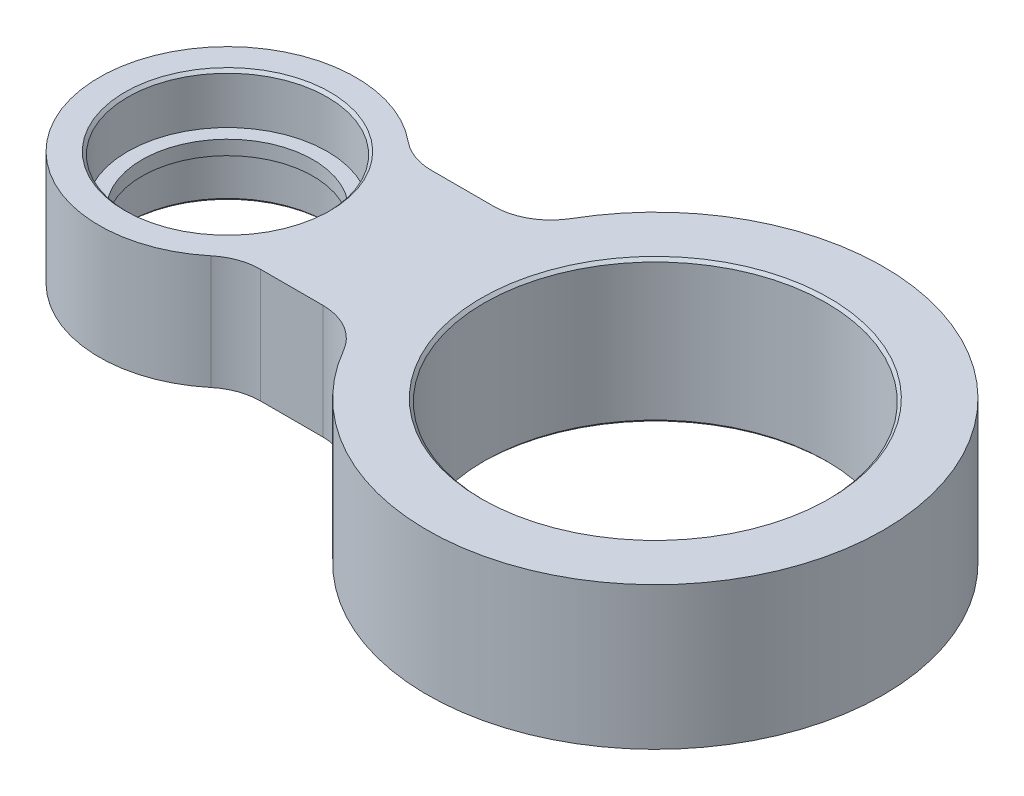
ISO-10303-21;
HEADER;
FILE_DESCRIPTION(('STEP AP214'),'2;1');
FILE_NAME('part.step','',(''),(''),'','','');
FILE_SCHEMA(('AUTOMOTIVE_DESIGN { 1 0 10303 214 1 1 1 1 }'));
ENDSEC;
DATA;
#1=APPLICATION_CONTEXT('core data for automotive mechanical design processes');
#2=APPLICATION_PROTOCOL_DEFINITION('international standard','automotive_design',2000,#1);
#3=PRODUCT_CONTEXT('',#1,'mechanical');
#4=PRODUCT('Part','Part','',(#3));
#5=PRODUCT_RELATED_PRODUCT_CATEGORY('part','',(#4));
#6=PRODUCT_DEFINITION_FORMATION('','',#4);
#7=PRODUCT_DEFINITION_CONTEXT('part definition',#1,'design');
#8=PRODUCT_DEFINITION('design','',#6,#7);
#9=PRODUCT_DEFINITION_SHAPE('','',#8);
#10=(LENGTH_UNIT() NAMED_UNIT(*) SI_UNIT(.MILLI.,.METRE.));
#11=(NAMED_UNIT(*) PLANE_ANGLE_UNIT() SI_UNIT($,.RADIAN.));
#12=(NAMED_UNIT(*) SI_UNIT($,.STERADIAN.) SOLID_ANGLE_UNIT());
#13=UNCERTAINTY_MEASURE_WITH_UNIT(LENGTH_MEASURE(1.E-05),#10,'distance_accuracy_value','');
#14=(GEOMETRIC_REPRESENTATION_CONTEXT(3) GLOBAL_UNCERTAINTY_ASSIGNED_CONTEXT((#13)) GLOBAL_UNIT_ASSIGNED_CONTEXT((#10,
#11,#12)) REPRESENTATION_CONTEXT('',''));
#15=CARTESIAN_POINT('',(0.,0.,0.));
#16=DIRECTION('',(0.,0.,1.));
#17=DIRECTION('',(1.,0.,0.));
#18=AXIS2_PLACEMENT_3D('',#15,#16,#17);
#19=CARTESIAN_POINT('',(-30.,0.45,0.));
#20=DIRECTION('',(0.,1.,0.));
#21=DIRECTION('',(0.,0.,1.));
#22=AXIS2_PLACEMENT_3D('',#19,#20,#21);
#23=CYLINDRICAL_SURFACE('',#22,6.);
#24=CARTESIAN_POINT('',(-30.,1.5,0.));
#25=DIRECTION('',(0.,1.,0.));
#26=DIRECTION('',(0.,0.,1.));
#27=AXIS2_PLACEMENT_3D('',#24,#25,#26);
#28=CIRCLE('',#27,6.);
#29=CARTESIAN_POINT('',(-30.,1.5,6.));
#30=VERTEX_POINT('',#29);
#31=EDGE_CURVE('E127',#30,#30,#28,.F.);
#32=ORIENTED_EDGE('',*,*,#31,.F.);
#33=EDGE_LOOP('',(#32));
#34=FACE_BOUND('',#33,.T.);
#35=CARTESIAN_POINT('',(-30.,0.5,0.));
#36=DIRECTION('',(0.,1.,0.));
#37=DIRECTION('',(0.,0.,1.));
#38=AXIS2_PLACEMENT_3D('',#35,#36,#37);
#39=CIRCLE('',#38,6.);
#40=CARTESIAN_POINT('',(-30.,0.5,6.));
#41=VERTEX_POINT('',#40);
#42=EDGE_CURVE('E19',#41,#41,#39,.F.);
#43=ORIENTED_EDGE('',*,*,#42,.T.);
#44=EDGE_LOOP('',(#43));
#45=FACE_BOUND('',#44,.T.);
#46=ADVANCED_FACE('F16',(#34,#45),#23,.F.);
#47=CARTESIAN_POINT('',(-30.,0.5,0.));
#48=DIRECTION('',(0.,1.,0.));
#49=DIRECTION('',(0.,0.,1.));
#50=AXIS2_PLACEMENT_3D('',#47,#48,#49);
#51=PLANE('',#50);
#52=ORIENTED_EDGE('',*,*,#42,.F.);
#53=EDGE_LOOP('',(#52));
#54=FACE_BOUND('',#53,.T.);
#55=CARTESIAN_POINT('',(-30.,0.5,0.));
#56=DIRECTION('',(0.,1.,0.));
#57=DIRECTION('',(0.,0.,1.));
#58=AXIS2_PLACEMENT_3D('',#55,#56,#57);
#59=CIRCLE('',#58,7.);
#60=CARTESIAN_POINT('',(-30.,0.5,7.));
#61=VERTEX_POINT('',#60);
#62=EDGE_CURVE('E125',#61,#61,#59,.F.);
#63=ORIENTED_EDGE('',*,*,#62,.T.);
#64=EDGE_LOOP('',(#63));
#65=FACE_BOUND('',#64,.T.);
#66=ADVANCED_FACE('F135',(#54,#65),#51,.F.);
#67=CARTESIAN_POINT('',(-30.,1.5,0.));
#68=DIRECTION('',(0.,1.,0.));
#69=DIRECTION('',(0.,0.,1.));
#70=AXIS2_PLACEMENT_3D('',#67,#68,#69);
#71=PLANE('',#70);
#72=ORIENTED_EDGE('',*,*,#31,.T.);
#73=EDGE_LOOP('',(#72));
#74=FACE_BOUND('',#73,.T.);
#75=CARTESIAN_POINT('',(-30.,1.5,0.));
#76=DIRECTION('',(0.,1.,0.));
#77=DIRECTION('',(0.,0.,1.));
#78=AXIS2_PLACEMENT_3D('',#75,#76,#77);
#79=CIRCLE('',#78,7.);
#80=CARTESIAN_POINT('',(-30.,1.5,7.));
#81=VERTEX_POINT('',#80);
#82=EDGE_CURVE('E121',#81,#81,#79,.T.);
#83=ORIENTED_EDGE('',*,*,#82,.T.);
#84=EDGE_LOOP('',(#83));
#85=FACE_BOUND('',#84,.T.);
#86=ADVANCED_FACE('F138',(#74,#85),#71,.T.);
#87=CARTESIAN_POINT('',(-30.,-5.,0.));
#88=DIRECTION('',(0.,1.,0.));
#89=DIRECTION('',(0.,0.,1.));
#90=AXIS2_PLACEMENT_3D('',#87,#88,#89);
#91=CYLINDRICAL_SURFACE('',#90,7.);
#92=ORIENTED_EDGE('',*,*,#62,.F.);
#93=EDGE_LOOP('',(#92));
#94=FACE_BOUND('',#93,.T.);
#95=CARTESIAN_POINT('',(-30.,-2.79999999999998,0.));
#96=DIRECTION('',(0.,-1.,0.));
#97=DIRECTION('',(-1.,0.,0.));
#98=AXIS2_PLACEMENT_3D('',#95,#96,#97);
#99=CIRCLE('',#98,7.00000000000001);
#100=CARTESIAN_POINT('',(-37.,-2.79999999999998,0.));
#101=VERTEX_POINT('',#100);
#102=EDGE_CURVE('E124',#101,#101,#99,.T.);
#103=ORIENTED_EDGE('',*,*,#102,.T.);
#104=EDGE_LOOP('',(#103));
#105=FACE_BOUND('',#104,.T.);
#106=ADVANCED_FACE('F141',(#94,#105),#91,.F.);
#107=CARTESIAN_POINT('',(-30.,-5.,0.));
#108=DIRECTION('',(0.,1.,0.));
#109=DIRECTION('',(0.,0.,1.));
#110=AXIS2_PLACEMENT_3D('',#107,#108,#109);
#111=CYLINDRICAL_SURFACE('',#110,7.);
#112=CARTESIAN_POINT('',(-30.,4.79999999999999,0.));
#113=DIRECTION('',(0.,1.,0.));
#114=DIRECTION('',(1.,0.,0.));
#115=AXIS2_PLACEMENT_3D('',#112,#113,#114);
#116=CIRCLE('',#115,7.00000000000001);
#117=CARTESIAN_POINT('',(-23.,4.79999999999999,0.));
#118=VERTEX_POINT('',#117);
#119=EDGE_CURVE('E107',#118,#118,#116,.T.);
#120=ORIENTED_EDGE('',*,*,#119,.T.);
#121=EDGE_LOOP('',(#120));
#122=FACE_BOUND('',#121,.T.);
#123=ORIENTED_EDGE('',*,*,#82,.F.);
#124=EDGE_LOOP('',(#123));
#125=FACE_BOUND('',#124,.T.);
#126=ADVANCED_FACE('F144',(#122,#125),#111,.F.);
#127=CARTESIAN_POINT('',(-30.,-3.00000000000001,0.));
#128=DIRECTION('',(0.,-1.,0.));
#129=DIRECTION('',(0.,0.,-1.));
#130=AXIS2_PLACEMENT_3D('',#127,#128,#129);
#131=CONICAL_SURFACE('',#130,7.19999999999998,0.785398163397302);
#132=ORIENTED_EDGE('',*,*,#102,.F.);
#133=EDGE_LOOP('',(#132));
#134=FACE_BOUND('',#133,.T.);
#135=CARTESIAN_POINT('',(-30.,-3.00000000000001,0.));
#136=DIRECTION('',(0.,-1.,0.));
#137=DIRECTION('',(0.,0.,-1.));
#138=AXIS2_PLACEMENT_3D('',#135,#136,#137);
#139=CIRCLE('',#138,7.19999999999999);
#140=CARTESIAN_POINT('',(-30.,-3.00000000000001,-7.19999999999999));
#141=VERTEX_POINT('',#140);
#142=EDGE_CURVE('E193',#141,#141,#139,.T.);
#143=ORIENTED_EDGE('',*,*,#142,.T.);
#144=EDGE_LOOP('',(#143));
#145=FACE_BOUND('',#144,.T.);
#146=ADVANCED_FACE('F310',(#134,#145),#131,.F.);
#147=CARTESIAN_POINT('',(0.,-5.,0.));
#148=DIRECTION('',(0.,1.,0.));
#149=DIRECTION('',(0.,0.,1.));
#150=AXIS2_PLACEMENT_3D('',#147,#148,#149);
#151=CYLINDRICAL_SURFACE('',#150,12.);
#152=CARTESIAN_POINT('',(0.,4.79999999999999,0.));
#153=DIRECTION('',(0.,1.,0.));
#154=DIRECTION('',(1.,0.,0.));
#155=AXIS2_PLACEMENT_3D('',#152,#153,#154);
#156=CIRCLE('',#155,12.);
#157=CARTESIAN_POINT('',(12.,4.79999999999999,0.));
#158=VERTEX_POINT('',#157);
#159=EDGE_CURVE('E99',#158,#158,#156,.T.);
#160=ORIENTED_EDGE('',*,*,#159,.T.);
#161=EDGE_LOOP('',(#160));
#162=FACE_BOUND('',#161,.T.);
#163=CARTESIAN_POINT('',(0.,-4.79999999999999,0.));
#164=DIRECTION('',(0.,-1.,0.));
#165=DIRECTION('',(-1.,0.,0.));
#166=AXIS2_PLACEMENT_3D('',#163,#164,#165);
#167=CIRCLE('',#166,12.);
#168=CARTESIAN_POINT('',(-12.,-4.79999999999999,0.));
#169=VERTEX_POINT('',#168);
#170=EDGE_CURVE('E216',#169,#169,#167,.T.);
#171=ORIENTED_EDGE('',*,*,#170,.T.);
#172=EDGE_LOOP('',(#171));
#173=FACE_BOUND('',#172,.T.);
#174=ADVANCED_FACE('F307',(#162,#173),#151,.F.);
#175=CARTESIAN_POINT('',(-17.32050807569,-5.,-6.));
#176=DIRECTION('',(0.,0.,-1.));
#177=DIRECTION('',(-1.,0.,0.));
#178=AXIS2_PLACEMENT_3D('',#175,#176,#177);
#179=PLANE('',#178);
#180=DIRECTION('',(0.,1.,0.));
#181=VECTOR('',#180,1.);
#182=CARTESIAN_POINT('',(-17.32050807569,-5.,-6.));
#183=LINE('',#182,#181);
#184=CARTESIAN_POINT('',(-17.32050807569,5.,-6.));
#185=VERTEX_POINT('',#184);
#186=CARTESIAN_POINT('',(-17.32050807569,-3.,-6.));
#187=VERTEX_POINT('',#186);
#188=EDGE_CURVE('E192',#185,#187,#183,.F.);
#189=ORIENTED_EDGE('',*,*,#188,.T.);
#190=DIRECTION('',(1.,0.,0.));
#191=VECTOR('',#190,1.);
#192=CARTESIAN_POINT('',(-15.,-3.,-6.));
#193=LINE('',#192,#191);
#194=CARTESIAN_POINT('',(-21.69337613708,-3.,-6.));
#195=VERTEX_POINT('',#194);
#196=EDGE_CURVE('E114',#187,#195,#193,.F.);
#197=ORIENTED_EDGE('',*,*,#196,.T.);
#198=DIRECTION('',(0.,1.,0.));
#199=VECTOR('',#198,1.);
#200=CARTESIAN_POINT('',(-21.69337613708,-5.,-6.));
#201=LINE('',#200,#199);
#202=CARTESIAN_POINT('',(-21.69337613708,5.,-6.));
#203=VERTEX_POINT('',#202);
#204=EDGE_CURVE('E149',#195,#203,#201,.T.);
#205=ORIENTED_EDGE('',*,*,#204,.T.);
#206=DIRECTION('',(1.,0.,0.));
#207=VECTOR('',#206,1.);
#208=CARTESIAN_POINT('',(0.,5.,-6.));
#209=LINE('',#208,#207);
#210=EDGE_CURVE('E186',#185,#203,#209,.F.);
#211=ORIENTED_EDGE('',*,*,#210,.F.);
#212=EDGE_LOOP('',(#189,#197,#205,#211));
#213=FACE_BOUND('',#212,.T.);
#214=ADVANCED_FACE('F304',(#213),#179,.T.);
#215=CARTESIAN_POINT('',(-21.69337613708,-5.,-10.));
#216=DIRECTION('',(0.,1.,0.));
#217=DIRECTION('',(0.,0.,1.));
#218=AXIS2_PLACEMENT_3D('',#215,#216,#217);
#219=CYLINDRICAL_SURFACE('',#218,4.);
#220=CARTESIAN_POINT('',(-21.69337613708,5.,-10.));
#221=DIRECTION('',(0.,1.,0.));
#222=DIRECTION('',(0.,0.,1.));
#223=AXIS2_PLACEMENT_3D('',#220,#221,#222);
#224=CIRCLE('',#223,4.);
#225=CARTESIAN_POINT('',(-24.2492604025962,5.,-6.9230769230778));
#226=VERTEX_POINT('',#225);
#227=EDGE_CURVE('E183',#203,#226,#224,.F.);
#228=ORIENTED_EDGE('',*,*,#227,.F.);
#229=ORIENTED_EDGE('',*,*,#204,.F.);
#230=CARTESIAN_POINT('',(-21.69337613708,-3.,-10.));
#231=DIRECTION('',(0.,1.,0.));
#232=DIRECTION('',(0.,0.,1.));
#233=AXIS2_PLACEMENT_3D('',#230,#231,#232);
#234=CIRCLE('',#233,4.);
#235=CARTESIAN_POINT('',(-24.2492604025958,-3.,-6.92307692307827));
#236=VERTEX_POINT('',#235);
#237=EDGE_CURVE('E116',#195,#236,#234,.F.);
#238=ORIENTED_EDGE('',*,*,#237,.T.);
#239=DIRECTION('',(0.,1.,0.));
#240=VECTOR('',#239,1.);
#241=CARTESIAN_POINT('',(-24.2492604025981,-5.,-6.92307692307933));
#242=LINE('',#241,#240);
#243=EDGE_CURVE('E87',#226,#236,#242,.F.);
#244=ORIENTED_EDGE('',*,*,#243,.F.);
#245=EDGE_LOOP('',(#228,#229,#238,#244));
#246=FACE_BOUND('',#245,.T.);
#247=ADVANCED_FACE('F202',(#246),#219,.F.);
#248=CARTESIAN_POINT('',(-30.,-5.,0.));
#249=DIRECTION('',(0.,1.,0.));
#250=DIRECTION('',(0.,0.,1.));
#251=AXIS2_PLACEMENT_3D('',#248,#249,#250);
#252=CYLINDRICAL_SURFACE('',#251,9.);
#253=ORIENTED_EDGE('',*,*,#243,.T.);
#254=CARTESIAN_POINT('',(-30.,-3.,0.));
#255=DIRECTION('',(0.,1.,0.));
#256=DIRECTION('',(0.,0.,1.));
#257=AXIS2_PLACEMENT_3D('',#254,#255,#256);
#258=CIRCLE('',#257,9.);
#259=CARTESIAN_POINT('',(-24.2492604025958,-3.,6.92307692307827));
#260=VERTEX_POINT('',#259);
#261=EDGE_CURVE('E90',#236,#260,#258,.T.);
#262=ORIENTED_EDGE('',*,*,#261,.T.);
#263=DIRECTION('',(0.,1.,0.));
#264=VECTOR('',#263,1.);
#265=CARTESIAN_POINT('',(-24.2492604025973,-5.,6.92307692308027));
#266=LINE('',#265,#264);
#267=CARTESIAN_POINT('',(-24.2492604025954,5.,6.92307692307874));
#268=VERTEX_POINT('',#267);
#269=EDGE_CURVE('E93',#260,#268,#266,.T.);
#270=ORIENTED_EDGE('',*,*,#269,.T.);
#271=CARTESIAN_POINT('',(-30.,5.,0.));
#272=DIRECTION('',(0.,1.,0.));
#273=DIRECTION('',(0.,0.,1.));
#274=AXIS2_PLACEMENT_3D('',#271,#272,#273);
#275=CIRCLE('',#274,9.);
#276=EDGE_CURVE('E181',#226,#268,#275,.T.);
#277=ORIENTED_EDGE('',*,*,#276,.F.);
#278=EDGE_LOOP('',(#253,#262,#270,#277));
#279=FACE_BOUND('',#278,.T.);
#280=ADVANCED_FACE('F92',(#279),#252,.T.);
#281=CARTESIAN_POINT('',(-21.69337613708,-5.,10.));
#282=DIRECTION('',(0.,1.,0.));
#283=DIRECTION('',(0.,0.,1.));
#284=AXIS2_PLACEMENT_3D('',#281,#282,#283);
#285=CYLINDRICAL_SURFACE('',#284,4.);
#286=CARTESIAN_POINT('',(-21.69337613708,5.,10.));
#287=DIRECTION('',(0.,1.,0.));
#288=DIRECTION('',(0.,0.,1.));
#289=AXIS2_PLACEMENT_3D('',#286,#287,#288);
#290=CIRCLE('',#289,4.);
#291=CARTESIAN_POINT('',(-21.69337613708,5.,6.));
#292=VERTEX_POINT('',#291);
#293=EDGE_CURVE('E105',#268,#292,#290,.F.);
#294=ORIENTED_EDGE('',*,*,#293,.F.);
#295=ORIENTED_EDGE('',*,*,#269,.F.);
#296=CARTESIAN_POINT('',(-21.69337613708,-3.,10.));
#297=DIRECTION('',(0.,1.,0.));
#298=DIRECTION('',(0.,0.,1.));
#299=AXIS2_PLACEMENT_3D('',#296,#297,#298);
#300=CIRCLE('',#299,4.);
#301=CARTESIAN_POINT('',(-21.69337613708,-3.,6.));
#302=VERTEX_POINT('',#301);
#303=EDGE_CURVE('E98',#260,#302,#300,.F.);
#304=ORIENTED_EDGE('',*,*,#303,.T.);
#305=DIRECTION('',(0.,1.,0.));
#306=VECTOR('',#305,1.);
#307=CARTESIAN_POINT('',(-21.69337613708,-5.,6.));
#308=LINE('',#307,#306);
#309=EDGE_CURVE('E195',#292,#302,#308,.F.);
#310=ORIENTED_EDGE('',*,*,#309,.F.);
#311=EDGE_LOOP('',(#294,#295,#304,#310));
#312=FACE_BOUND('',#311,.T.);
#313=ADVANCED_FACE('F102',(#312),#285,.F.);
#314=CARTESIAN_POINT('',(-30.,5.00000000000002,0.));
#315=DIRECTION('',(0.,1.,0.));
#316=DIRECTION('',(0.,0.,1.));
#317=AXIS2_PLACEMENT_3D('',#314,#315,#316);
#318=CONICAL_SURFACE('',#317,7.19999999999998,0.785398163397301);
#319=ORIENTED_EDGE('',*,*,#119,.F.);
#320=EDGE_LOOP('',(#319));
#321=FACE_BOUND('',#320,.T.);
#322=CARTESIAN_POINT('',(-30.,5.00000000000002,0.));
#323=DIRECTION('',(0.,1.,0.));
#324=DIRECTION('',(0.,0.,1.));
#325=AXIS2_PLACEMENT_3D('',#322,#323,#324);
#326=CIRCLE('',#325,7.19999999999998);
#327=CARTESIAN_POINT('',(-30.,5.00000000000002,7.19999999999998));
#328=VERTEX_POINT('',#327);
#329=EDGE_CURVE('E176',#328,#328,#326,.F.);
#330=ORIENTED_EDGE('',*,*,#329,.F.);
#331=EDGE_LOOP('',(#330));
#332=FACE_BOUND('',#331,.T.);
#333=ADVANCED_FACE('F238',(#321,#332),#318,.F.);
#334=CARTESIAN_POINT('',(0.,5.00000000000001,0.));
#335=DIRECTION('',(0.,1.,0.));
#336=DIRECTION('',(0.,0.,1.));
#337=AXIS2_PLACEMENT_3D('',#334,#335,#336);
#338=CONICAL_SURFACE('',#337,12.2,0.785398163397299);
#339=ORIENTED_EDGE('',*,*,#159,.F.);
#340=EDGE_LOOP('',(#339));
#341=FACE_BOUND('',#340,.T.);
#342=CARTESIAN_POINT('',(0.,5.00000000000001,0.));
#343=DIRECTION('',(0.,1.,0.));
#344=DIRECTION('',(0.,0.,1.));
#345=AXIS2_PLACEMENT_3D('',#342,#343,#344);
#346=CIRCLE('',#345,12.2);
#347=CARTESIAN_POINT('',(0.,5.00000000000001,12.2));
#348=VERTEX_POINT('',#347);
#349=EDGE_CURVE('E173',#348,#348,#346,.F.);
#350=ORIENTED_EDGE('',*,*,#349,.F.);
#351=EDGE_LOOP('',(#350));
#352=FACE_BOUND('',#351,.T.);
#353=ADVANCED_FACE('F241',(#341,#352),#338,.F.);
#354=CARTESIAN_POINT('',(-15.,-3.,19.20259792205));
#355=DIRECTION('',(0.,1.,0.));
#356=DIRECTION('',(0.,0.,1.));
#357=AXIS2_PLACEMENT_3D('',#354,#355,#356);
#358=PLANE('',#357);
#359=ORIENTED_EDGE('',*,*,#142,.F.);
#360=EDGE_LOOP('',(#359));
#361=FACE_BOUND('',#360,.T.);
#362=ORIENTED_EDGE('',*,*,#196,.F.);
#363=CARTESIAN_POINT('',(-17.32050807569,-3.,-10.));
#364=DIRECTION('',(0.,1.,0.));
#365=DIRECTION('',(0.,0.,1.));
#366=AXIS2_PLACEMENT_3D('',#363,#364,#365);
#367=CIRCLE('',#366,4.);
#368=CARTESIAN_POINT('',(-15.0000000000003,-3.,-6.74189590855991));
#369=VERTEX_POINT('',#368);
#370=EDGE_CURVE('E190',#187,#369,#367,.T.);
#371=ORIENTED_EDGE('',*,*,#370,.T.);
#372=DIRECTION('',(0.,0.,-1.));
#373=VECTOR('',#372,1.);
#374=CARTESIAN_POINT('',(-15.,-3.,19.20259792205));
#375=LINE('',#374,#373);
#376=CARTESIAN_POINT('',(-15.0000000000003,-3.,6.74189590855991));
#377=VERTEX_POINT('',#376);
#378=EDGE_CURVE('E220',#369,#377,#375,.F.);
#379=ORIENTED_EDGE('',*,*,#378,.T.);
#380=CARTESIAN_POINT('',(-17.32050807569,-3.,10.));
#381=DIRECTION('',(0.,1.,0.));
#382=DIRECTION('',(0.,0.,1.));
#383=AXIS2_PLACEMENT_3D('',#380,#381,#382);
#384=CIRCLE('',#383,4.);
#385=CARTESIAN_POINT('',(-17.32050807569,-3.,6.));
#386=VERTEX_POINT('',#385);
#387=EDGE_CURVE('E170',#377,#386,#384,.T.);
#388=ORIENTED_EDGE('',*,*,#387,.T.);
#389=DIRECTION('',(1.,0.,0.));
#390=VECTOR('',#389,1.);
#391=CARTESIAN_POINT('',(-21.69337613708,-3.,6.));
#392=LINE('',#391,#390);
#393=EDGE_CURVE('E112',#302,#386,#392,.T.);
#394=ORIENTED_EDGE('',*,*,#393,.F.);
#395=ORIENTED_EDGE('',*,*,#303,.F.);
#396=ORIENTED_EDGE('',*,*,#261,.F.);
#397=ORIENTED_EDGE('',*,*,#237,.F.);
#398=EDGE_LOOP('',(#362,#371,#379,#388,#394,#395,#396,#397));
#399=FACE_BOUND('',#398,.T.);
#400=ADVANCED_FACE('F110',(#361,#399),#358,.F.);
#401=CARTESIAN_POINT('',(-21.69337613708,-5.,6.));
#402=DIRECTION('',(0.,0.,1.));
#403=DIRECTION('',(1.,0.,0.));
#404=AXIS2_PLACEMENT_3D('',#401,#402,#403);
#405=PLANE('',#404);
#406=ORIENTED_EDGE('',*,*,#309,.T.);
#407=ORIENTED_EDGE('',*,*,#393,.T.);
#408=DIRECTION('',(0.,1.,0.));
#409=VECTOR('',#408,1.);
#410=CARTESIAN_POINT('',(-17.32050807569,-5.,6.));
#411=LINE('',#410,#409);
#412=CARTESIAN_POINT('',(-17.32050807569,5.,6.));
#413=VERTEX_POINT('',#412);
#414=EDGE_CURVE('E169',#386,#413,#411,.T.);
#415=ORIENTED_EDGE('',*,*,#414,.T.);
#416=DIRECTION('',(1.,0.,0.));
#417=VECTOR('',#416,1.);
#418=CARTESIAN_POINT('',(0.,5.,6.));
#419=LINE('',#418,#417);
#420=EDGE_CURVE('E179',#292,#413,#419,.T.);
#421=ORIENTED_EDGE('',*,*,#420,.F.);
#422=EDGE_LOOP('',(#406,#407,#415,#421));
#423=FACE_BOUND('',#422,.T.);
#424=ADVANCED_FACE('F288',(#423),#405,.T.);
#425=CARTESIAN_POINT('',(-15.,-13.,19.20259792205));
#426=DIRECTION('',(1.,0.,0.));
#427=DIRECTION('',(0.,0.,-1.));
#428=AXIS2_PLACEMENT_3D('',#425,#426,#427);
#429=PLANE('',#428);
#430=ORIENTED_EDGE('',*,*,#378,.F.);
#431=DIRECTION('',(0.,1.,0.));
#432=VECTOR('',#431,1.);
#433=CARTESIAN_POINT('',(-15.0000000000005,-5.,-6.74189590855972));
#434=LINE('',#433,#432);
#435=CARTESIAN_POINT('',(-15.0000000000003,-5.,-6.74189590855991));
#436=VERTEX_POINT('',#435);
#437=EDGE_CURVE('E210',#369,#436,#434,.F.);
#438=ORIENTED_EDGE('',*,*,#437,.T.);
#439=DIRECTION('',(0.,0.,1.));
#440=VECTOR('',#439,1.);
#441=CARTESIAN_POINT('',(-15.,-5.,0.));
#442=LINE('',#441,#440);
#443=CARTESIAN_POINT('',(-15.0000000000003,-5.,6.74189590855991));
#444=VERTEX_POINT('',#443);
#445=EDGE_CURVE('E166',#436,#444,#442,.T.);
#446=ORIENTED_EDGE('',*,*,#445,.T.);
#447=DIRECTION('',(0.,1.,0.));
#448=VECTOR('',#447,1.);
#449=CARTESIAN_POINT('',(-15.0000000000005,-5.,6.74189590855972));
#450=LINE('',#449,#448);
#451=EDGE_CURVE('E172',#444,#377,#450,.T.);
#452=ORIENTED_EDGE('',*,*,#451,.T.);
#453=EDGE_LOOP('',(#430,#438,#446,#452));
#454=FACE_BOUND('',#453,.T.);
#455=ADVANCED_FACE('F263',(#454),#429,.F.);
#456=CARTESIAN_POINT('',(0.,-5.00000000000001,0.));
#457=DIRECTION('',(0.,-1.,0.));
#458=DIRECTION('',(0.,0.,-1.));
#459=AXIS2_PLACEMENT_3D('',#456,#457,#458);
#460=CONICAL_SURFACE('',#459,12.2,0.785398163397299);
#461=ORIENTED_EDGE('',*,*,#170,.F.);
#462=EDGE_LOOP('',(#461));
#463=FACE_BOUND('',#462,.T.);
#464=CARTESIAN_POINT('',(0.,-5.00000000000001,0.));
#465=DIRECTION('',(0.,-1.,0.));
#466=DIRECTION('',(0.,0.,-1.));
#467=AXIS2_PLACEMENT_3D('',#464,#465,#466);
#468=CIRCLE('',#467,12.2);
#469=CARTESIAN_POINT('',(0.,-5.00000000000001,-12.2));
#470=VERTEX_POINT('',#469);
#471=EDGE_CURVE('E159',#470,#470,#468,.T.);
#472=ORIENTED_EDGE('',*,*,#471,.T.);
#473=EDGE_LOOP('',(#472));
#474=FACE_BOUND('',#473,.T.);
#475=ADVANCED_FACE('F282',(#463,#474),#460,.F.);
#476=CARTESIAN_POINT('',(-17.32050807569,-5.,-10.));
#477=DIRECTION('',(0.,1.,0.));
#478=DIRECTION('',(0.,0.,1.));
#479=AXIS2_PLACEMENT_3D('',#476,#477,#478);
#480=CYLINDRICAL_SURFACE('',#479,4.);
#481=ORIENTED_EDGE('',*,*,#188,.F.);
#482=CARTESIAN_POINT('',(-17.32050807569,5.,-10.));
#483=DIRECTION('',(0.,1.,0.));
#484=DIRECTION('',(0.,0.,1.));
#485=AXIS2_PLACEMENT_3D('',#482,#483,#484);
#486=CIRCLE('',#485,4.);
#487=CARTESIAN_POINT('',(-13.8564064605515,5.,-8.00000000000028));
#488=VERTEX_POINT('',#487);
#489=EDGE_CURVE('E187',#488,#185,#486,.F.);
#490=ORIENTED_EDGE('',*,*,#489,.F.);
#491=DIRECTION('',(0.,1.,0.));
#492=VECTOR('',#491,1.);
#493=CARTESIAN_POINT('',(-13.8564064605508,-5.,-8.00000000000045));
#494=LINE('',#493,#492);
#495=CARTESIAN_POINT('',(-13.8564064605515,-5.,-8.00000000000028));
#496=VERTEX_POINT('',#495);
#497=EDGE_CURVE('E158',#496,#488,#494,.T.);
#498=ORIENTED_EDGE('',*,*,#497,.F.);
#499=CARTESIAN_POINT('',(-17.32050807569,-5.,-10.));
#500=DIRECTION('',(0.,1.,0.));
#501=DIRECTION('',(0.,0.,1.));
#502=AXIS2_PLACEMENT_3D('',#499,#500,#501);
#503=CIRCLE('',#502,4.);
#504=EDGE_CURVE('E162',#496,#436,#503,.F.);
#505=ORIENTED_EDGE('',*,*,#504,.T.);
#506=ORIENTED_EDGE('',*,*,#437,.F.);
#507=ORIENTED_EDGE('',*,*,#370,.F.);
#508=EDGE_LOOP('',(#481,#490,#498,#505,#506,#507));
#509=FACE_BOUND('',#508,.T.);
#510=ADVANCED_FACE('F207',(#509),#480,.F.);
#511=CARTESIAN_POINT('',(0.,5.,0.));
#512=DIRECTION('',(0.,1.,0.));
#513=DIRECTION('',(0.,0.,1.));
#514=AXIS2_PLACEMENT_3D('',#511,#512,#513);
#515=PLANE('',#514);
#516=ORIENTED_EDGE('',*,*,#349,.T.);
#517=EDGE_LOOP('',(#516));
#518=FACE_BOUND('',#517,.T.);
#519=ORIENTED_EDGE('',*,*,#329,.T.);
#520=EDGE_LOOP('',(#519));
#521=FACE_BOUND('',#520,.T.);
#522=CARTESIAN_POINT('',(-17.32050807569,5.,10.));
#523=DIRECTION('',(0.,1.,0.));
#524=DIRECTION('',(0.,0.,1.));
#525=AXIS2_PLACEMENT_3D('',#522,#523,#524);
#526=CIRCLE('',#525,4.);
#527=CARTESIAN_POINT('',(-13.8564064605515,5.,8.00000000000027));
#528=VERTEX_POINT('',#527);
#529=EDGE_CURVE('E167',#413,#528,#526,.F.);
#530=ORIENTED_EDGE('',*,*,#529,.T.);
#531=CARTESIAN_POINT('',(0.,5.,0.));
#532=DIRECTION('',(0.,1.,0.));
#533=DIRECTION('',(0.,0.,1.));
#534=AXIS2_PLACEMENT_3D('',#531,#532,#533);
#535=CIRCLE('',#534,16.);
#536=EDGE_CURVE('E155',#488,#528,#535,.F.);
#537=ORIENTED_EDGE('',*,*,#536,.F.);
#538=ORIENTED_EDGE('',*,*,#489,.T.);
#539=ORIENTED_EDGE('',*,*,#210,.T.);
#540=ORIENTED_EDGE('',*,*,#227,.T.);
#541=ORIENTED_EDGE('',*,*,#276,.T.);
#542=ORIENTED_EDGE('',*,*,#293,.T.);
#543=ORIENTED_EDGE('',*,*,#420,.T.);
#544=EDGE_LOOP('',(#530,#537,#538,#539,#540,#541,#542,#543));
#545=FACE_BOUND('',#544,.T.);
#546=ADVANCED_FACE('F245',(#518,#521,#545),#515,.T.);
#547=CARTESIAN_POINT('',(-17.32050807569,-5.,10.));
#548=DIRECTION('',(0.,1.,0.));
#549=DIRECTION('',(0.,0.,1.));
#550=AXIS2_PLACEMENT_3D('',#547,#548,#549);
#551=CYLINDRICAL_SURFACE('',#550,4.);
#552=DIRECTION('',(0.,1.,0.));
#553=VECTOR('',#552,1.);
#554=CARTESIAN_POINT('',(-13.8564064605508,-5.,8.00000000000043));
#555=LINE('',#554,#553);
#556=CARTESIAN_POINT('',(-13.8564064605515,-5.,8.00000000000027));
#557=VERTEX_POINT('',#556);
#558=EDGE_CURVE('E25',#528,#557,#555,.F.);
#559=ORIENTED_EDGE('',*,*,#558,.F.);
#560=ORIENTED_EDGE('',*,*,#529,.F.);
#561=ORIENTED_EDGE('',*,*,#414,.F.);
#562=ORIENTED_EDGE('',*,*,#387,.F.);
#563=ORIENTED_EDGE('',*,*,#451,.F.);
#564=CARTESIAN_POINT('',(-17.32050807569,-5.,10.));
#565=DIRECTION('',(0.,1.,0.));
#566=DIRECTION('',(0.,0.,1.));
#567=AXIS2_PLACEMENT_3D('',#564,#565,#566);
#568=CIRCLE('',#567,4.);
#569=EDGE_CURVE('E34',#444,#557,#568,.F.);
#570=ORIENTED_EDGE('',*,*,#569,.T.);
#571=EDGE_LOOP('',(#559,#560,#561,#562,#563,#570));
#572=FACE_BOUND('',#571,.T.);
#573=ADVANCED_FACE('F248',(#572),#551,.F.);
#574=CARTESIAN_POINT('',(0.,-5.,0.));
#575=DIRECTION('',(0.,1.,0.));
#576=DIRECTION('',(0.,0.,1.));
#577=AXIS2_PLACEMENT_3D('',#574,#575,#576);
#578=PLANE('',#577);
#579=ORIENTED_EDGE('',*,*,#471,.F.);
#580=EDGE_LOOP('',(#579));
#581=FACE_BOUND('',#580,.T.);
#582=CARTESIAN_POINT('',(0.,-5.,0.));
#583=DIRECTION('',(0.,1.,0.));
#584=DIRECTION('',(0.,0.,1.));
#585=AXIS2_PLACEMENT_3D('',#582,#583,#584);
#586=CIRCLE('',#585,16.);
#587=EDGE_CURVE('E11',#557,#496,#586,.T.);
#588=ORIENTED_EDGE('',*,*,#587,.F.);
#589=ORIENTED_EDGE('',*,*,#569,.F.);
#590=ORIENTED_EDGE('',*,*,#445,.F.);
#591=ORIENTED_EDGE('',*,*,#504,.F.);
#592=EDGE_LOOP('',(#588,#589,#590,#591));
#593=FACE_BOUND('',#592,.T.);
#594=ADVANCED_FACE('F266',(#581,#593),#578,.F.);
#595=CARTESIAN_POINT('',(0.,-5.,0.));
#596=DIRECTION('',(0.,1.,0.));
#597=DIRECTION('',(0.,0.,1.));
#598=AXIS2_PLACEMENT_3D('',#595,#596,#597);
#599=CYLINDRICAL_SURFACE('',#598,16.);
#600=ORIENTED_EDGE('',*,*,#558,.T.);
#601=ORIENTED_EDGE('',*,*,#587,.T.);
#602=ORIENTED_EDGE('',*,*,#497,.T.);
#603=ORIENTED_EDGE('',*,*,#536,.T.);
#604=EDGE_LOOP('',(#600,#601,#602,#603));
#605=FACE_BOUND('',#604,.T.);
#606=ADVANCED_FACE('F260',(#605),#599,.T.);
#607=CLOSED_SHELL('',(#46,#66,#86,#106,#126,#146,#174,#214,#247,#280,#313,#333,#353,#400,#424,
#455,#475,#510,#546,#573,#594,#606));
#608=MANIFOLD_SOLID_BREP('B1',#607);
#609=ADVANCED_BREP_SHAPE_REPRESENTATION('',(#18,#608),#14);
#610=SHAPE_DEFINITION_REPRESENTATION(#9,#609);
ENDSEC;
END-ISO-10303-21;
